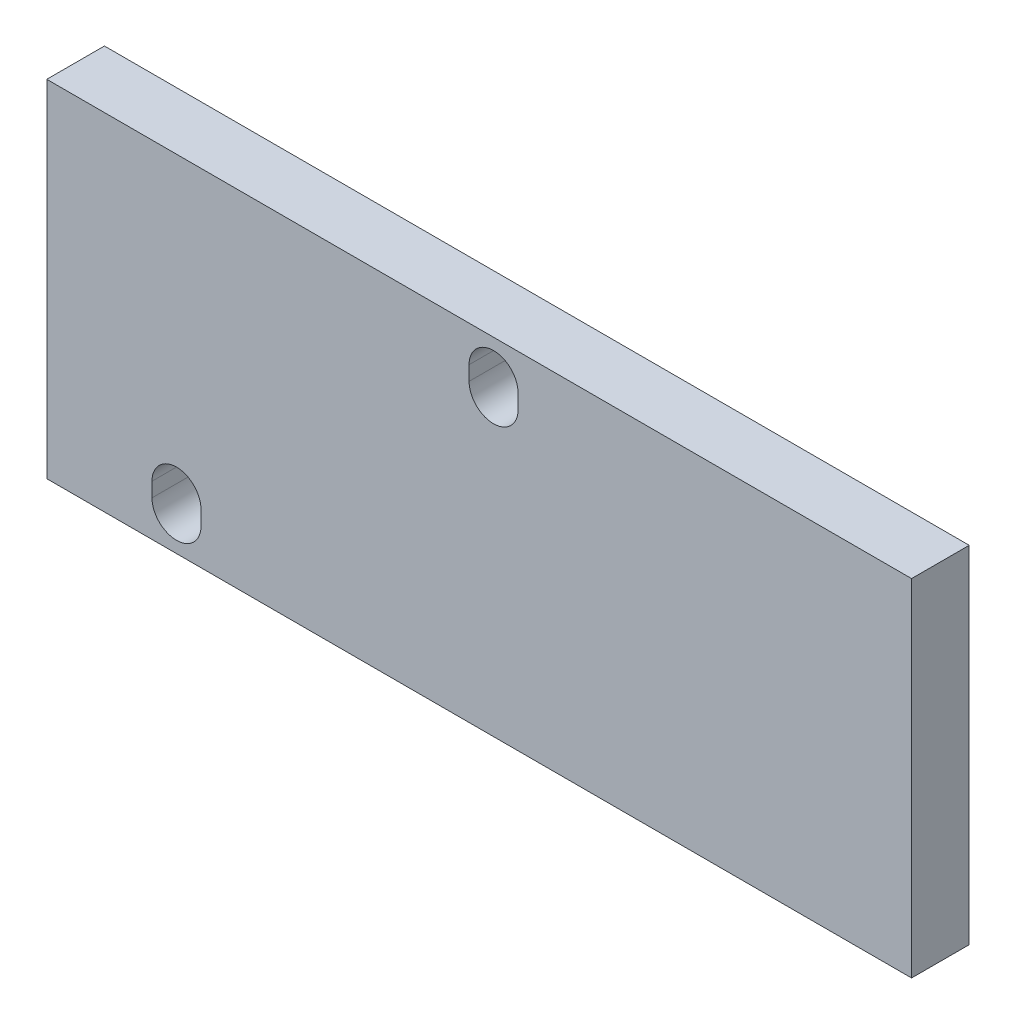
from build123d import *

# Parameters (mm, degrees)
ESQUISSE1_W             = 10
ESQUISSE1_H             = 60
EXTRUSION1_DEPTH        = 150
ENL_V_MAT_EXTRU_1_DEPTH = 162.864140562


with BuildPart() as part:
    # Esquisse1 → Extrusion1 (new body)
    with BuildSketch(Plane(origin=(0, 0, 0), x_dir=(0, 0, -1), z_dir=(1, 0, 0))):
        with Locations((5, 30)):
            Rectangle(ESQUISSE1_W, ESQUISSE1_H)
    extrude(amount=EXTRUSION1_DEPTH)

    # Esquisse2 → Enl_v. mat.-Extru.1 (cut, through all)
    with BuildSketch(Plane.XY):
        with BuildLine():
            Line((26.75, 6.25), (26.75, 8.75))
            ThreePointArc((26.75, 8.75), (22.5, 13), (18.25, 8.75))
            Line((18.25, 8.75), (18.25, 6.25))
            ThreePointArc((18.25, 6.25), (22.5, 2), (26.75, 6.25))
        make_face()
        with BuildLine():
            Line((81.75, 51.25), (81.75, 53.75))
            ThreePointArc((81.75, 53.75), (77.5, 58), (73.25, 53.75))
            Line((73.25, 53.75), (73.25, 51.25))
            ThreePointArc((73.25, 51.25), (77.5, 47), (81.75, 51.25))
        make_face()
    extrude(amount=-ENL_V_MAT_EXTRU_1_DEPTH, mode=Mode.SUBTRACT)


solid = part.part
